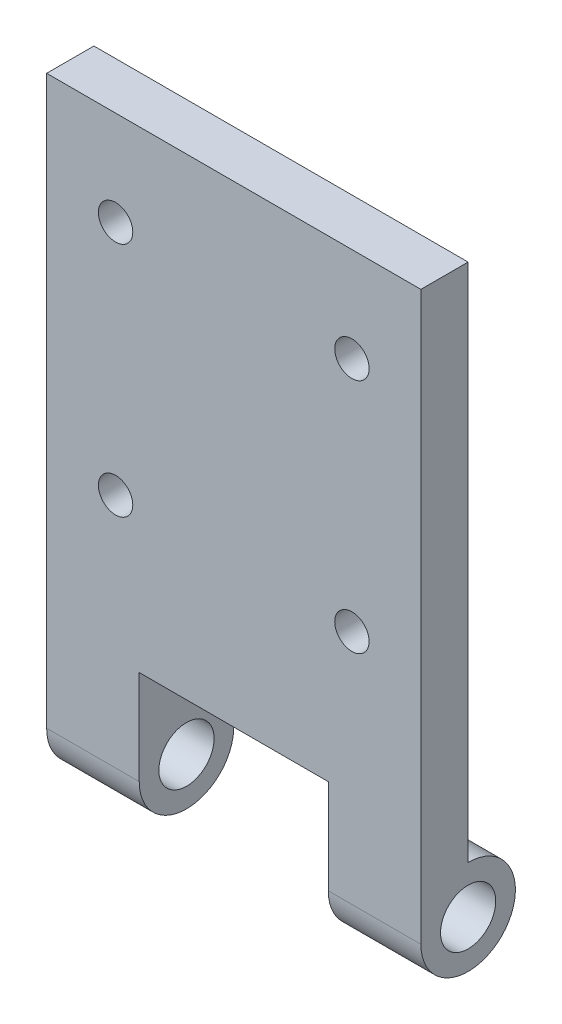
ISO-10303-21;
HEADER;
FILE_DESCRIPTION(('STEP AP214'),'2;1');
FILE_NAME('part.step','',(''),(''),'','','');
FILE_SCHEMA(('AUTOMOTIVE_DESIGN { 1 0 10303 214 1 1 1 1 }'));
ENDSEC;
DATA;
#1=APPLICATION_CONTEXT('core data for automotive mechanical design processes');
#2=APPLICATION_PROTOCOL_DEFINITION('international standard','automotive_design',2000,#1);
#3=PRODUCT_CONTEXT('',#1,'mechanical');
#4=PRODUCT('Part','Part','',(#3));
#5=PRODUCT_RELATED_PRODUCT_CATEGORY('part','',(#4));
#6=PRODUCT_DEFINITION_FORMATION('','',#4);
#7=PRODUCT_DEFINITION_CONTEXT('part definition',#1,'design');
#8=PRODUCT_DEFINITION('design','',#6,#7);
#9=PRODUCT_DEFINITION_SHAPE('','',#8);
#10=(LENGTH_UNIT() NAMED_UNIT(*) SI_UNIT(.MILLI.,.METRE.));
#11=(NAMED_UNIT(*) PLANE_ANGLE_UNIT() SI_UNIT($,.RADIAN.));
#12=(NAMED_UNIT(*) SI_UNIT($,.STERADIAN.) SOLID_ANGLE_UNIT());
#13=UNCERTAINTY_MEASURE_WITH_UNIT(LENGTH_MEASURE(1.E-05),#10,'distance_accuracy_value','');
#14=(GEOMETRIC_REPRESENTATION_CONTEXT(3) GLOBAL_UNCERTAINTY_ASSIGNED_CONTEXT((#13)) GLOBAL_UNIT_ASSIGNED_CONTEXT((#10,
#11,#12)) REPRESENTATION_CONTEXT('',''));
#15=CARTESIAN_POINT('',(0.,0.,0.));
#16=DIRECTION('',(0.,0.,1.));
#17=DIRECTION('',(1.,0.,0.));
#18=AXIS2_PLACEMENT_3D('',#15,#16,#17);
#19=CARTESIAN_POINT('',(-28.2842712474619,0.,0.));
#20=DIRECTION('',(1.,0.,0.));
#21=DIRECTION('',(0.,1.,0.));
#22=AXIS2_PLACEMENT_3D('',#19,#20,#21);
#23=CYLINDRICAL_SURFACE('',#22,10.);
#24=CARTESIAN_POINT('',(19.5881204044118,0.,0.));
#25=DIRECTION('',(-1.,0.,0.));
#26=DIRECTION('',(0.,0.,1.));
#27=AXIS2_PLACEMENT_3D('',#24,#25,#26);
#28=CIRCLE('',#27,10.);
#29=CARTESIAN_POINT('',(19.5881204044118,0.,10.));
#30=VERTEX_POINT('',#29);
#31=CARTESIAN_POINT('',(19.5881204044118,9.99999999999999,0.));
#32=VERTEX_POINT('',#31);
#33=EDGE_CURVE('E129',#30,#32,#28,.F.);
#34=ORIENTED_EDGE('',*,*,#33,.F.);
#35=DIRECTION('',(1.,0.,0.));
#36=VECTOR('',#35,1.);
#37=CARTESIAN_POINT('',(0.,0.,10.));
#38=LINE('',#37,#36);
#39=CARTESIAN_POINT('',(0.,0.,10.));
#40=VERTEX_POINT('',#39);
#41=EDGE_CURVE('E176',#40,#30,#38,.T.);
#42=ORIENTED_EDGE('',*,*,#41,.F.);
#43=CARTESIAN_POINT('',(0.,0.,0.));
#44=DIRECTION('',(1.,0.,0.));
#45=DIRECTION('',(0.,0.,-1.));
#46=AXIS2_PLACEMENT_3D('',#43,#44,#45);
#47=CIRCLE('',#46,10.);
#48=CARTESIAN_POINT('',(0.,9.99999999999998,0.));
#49=VERTEX_POINT('',#48);
#50=EDGE_CURVE('E142',#49,#40,#47,.F.);
#51=ORIENTED_EDGE('',*,*,#50,.F.);
#52=DIRECTION('',(1.,0.,0.));
#53=VECTOR('',#52,1.);
#54=CARTESIAN_POINT('',(-28.2842712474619,9.99999999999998,0.));
#55=LINE('',#54,#53);
#56=EDGE_CURVE('E56',#49,#32,#55,.T.);
#57=ORIENTED_EDGE('',*,*,#56,.T.);
#58=EDGE_LOOP('',(#34,#42,#51,#57));
#59=FACE_BOUND('',#58,.T.);
#60=ADVANCED_FACE('F33',(#59),#23,.T.);
#61=CARTESIAN_POINT('',(0.,0.,0.));
#62=DIRECTION('',(1.,0.,0.));
#63=DIRECTION('',(0.,1.,0.));
#64=AXIS2_PLACEMENT_3D('',#61,#62,#63);
#65=CYLINDRICAL_SURFACE('',#64,5.84494876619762);
#66=CARTESIAN_POINT('',(19.5881204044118,0.,0.));
#67=DIRECTION('',(-1.,0.,0.));
#68=DIRECTION('',(0.,0.,1.));
#69=AXIS2_PLACEMENT_3D('',#66,#67,#68);
#70=CIRCLE('',#69,5.84494876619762);
#71=CARTESIAN_POINT('',(19.5881204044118,5.8449487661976,0.));
#72=VERTEX_POINT('',#71);
#73=EDGE_CURVE('E128',#72,#72,#70,.F.);
#74=CARTESIAN_POINT('',(0.,0.,0.));
#75=DIRECTION('',(1.,0.,0.));
#76=DIRECTION('',(0.,1.,0.));
#77=AXIS2_PLACEMENT_3D('',#74,#75,#76);
#78=CIRCLE('',#77,5.84494876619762);
#79=CARTESIAN_POINT('',(0.,5.8449487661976,0.));
#80=VERTEX_POINT('',#79);
#81=EDGE_CURVE('E134',#80,#80,#78,.T.);
#82=CARTESIAN_POINT('',(19.5881204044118,5.8449487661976,0.));
#83=CARTESIAN_POINT('',(19.3840774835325,5.8449487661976,0.));
#84=CARTESIAN_POINT('',(19.1800345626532,5.8449487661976,0.));
#85=CARTESIAN_POINT('',(18.7719487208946,5.8449487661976,0.));
#86=CARTESIAN_POINT('',(18.5679058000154,5.8449487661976,0.));
#87=CARTESIAN_POINT('',(18.1598199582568,5.8449487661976,0.));
#88=CARTESIAN_POINT('',(17.9557770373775,5.8449487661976,0.));
#89=CARTESIAN_POINT('',(17.5476911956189,5.8449487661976,0.));
#90=CARTESIAN_POINT('',(17.3436482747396,5.8449487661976,0.));
#91=CARTESIAN_POINT('',(16.935562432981,5.8449487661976,0.));
#92=CARTESIAN_POINT('',(16.7315195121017,5.8449487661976,0.));
#93=CARTESIAN_POINT('',(16.3234336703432,5.8449487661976,0.));
#94=CARTESIAN_POINT('',(16.1193907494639,5.8449487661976,0.));
#95=CARTESIAN_POINT('',(15.7113049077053,5.8449487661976,0.));
#96=CARTESIAN_POINT('',(15.507261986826,5.8449487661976,0.));
#97=CARTESIAN_POINT('',(15.0991761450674,5.8449487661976,0.));
#98=CARTESIAN_POINT('',(14.8951332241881,5.8449487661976,0.));
#99=CARTESIAN_POINT('',(14.4870473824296,5.8449487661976,0.));
#100=CARTESIAN_POINT('',(14.2830044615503,5.8449487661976,0.));
#101=CARTESIAN_POINT('',(13.8749186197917,5.8449487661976,0.));
#102=CARTESIAN_POINT('',(13.6708756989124,5.8449487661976,0.));
#103=CARTESIAN_POINT('',(13.2627898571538,5.8449487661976,0.));
#104=CARTESIAN_POINT('',(13.0587469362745,5.8449487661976,0.));
#105=CARTESIAN_POINT('',(12.650661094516,5.8449487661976,0.));
#106=CARTESIAN_POINT('',(12.4466181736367,5.8449487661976,0.));
#107=CARTESIAN_POINT('',(12.0385323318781,5.8449487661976,0.));
#108=CARTESIAN_POINT('',(11.8344894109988,5.8449487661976,0.));
#109=CARTESIAN_POINT('',(11.4264035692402,5.8449487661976,0.));
#110=CARTESIAN_POINT('',(11.2223606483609,5.8449487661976,0.));
#111=CARTESIAN_POINT('',(10.8142748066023,5.8449487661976,0.));
#112=CARTESIAN_POINT('',(10.6102318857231,5.8449487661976,0.));
#113=CARTESIAN_POINT('',(10.2021460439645,5.8449487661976,0.));
#114=CARTESIAN_POINT('',(9.99810312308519,5.8449487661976,0.));
#115=CARTESIAN_POINT('',(9.59001728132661,5.8449487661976,0.));
#116=CARTESIAN_POINT('',(9.38597436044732,5.8449487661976,0.));
#117=CARTESIAN_POINT('',(8.97788851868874,5.8449487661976,0.));
#118=CARTESIAN_POINT('',(8.77384559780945,5.8449487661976,0.));
#119=CARTESIAN_POINT('',(8.36575975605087,5.8449487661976,0.));
#120=CARTESIAN_POINT('',(8.16171683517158,5.8449487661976,0.));
#121=CARTESIAN_POINT('',(7.753630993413,5.8449487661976,0.));
#122=CARTESIAN_POINT('',(7.54958807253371,5.8449487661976,0.));
#123=CARTESIAN_POINT('',(7.14150223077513,5.8449487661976,0.));
#124=CARTESIAN_POINT('',(6.93745930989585,5.8449487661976,0.));
#125=CARTESIAN_POINT('',(6.52937346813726,5.8449487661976,0.));
#126=CARTESIAN_POINT('',(6.32533054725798,5.8449487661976,0.));
#127=CARTESIAN_POINT('',(5.9172447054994,5.8449487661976,0.));
#128=CARTESIAN_POINT('',(5.71320178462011,5.8449487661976,0.));
#129=CARTESIAN_POINT('',(5.30511594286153,5.8449487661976,0.));
#130=CARTESIAN_POINT('',(5.10107302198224,5.8449487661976,0.));
#131=CARTESIAN_POINT('',(4.69298718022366,5.8449487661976,0.));
#132=CARTESIAN_POINT('',(4.48894425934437,5.8449487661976,0.));
#133=CARTESIAN_POINT('',(4.08085841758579,5.8449487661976,0.));
#134=CARTESIAN_POINT('',(3.8768154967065,5.8449487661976,0.));
#135=CARTESIAN_POINT('',(3.46872965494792,5.8449487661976,0.));
#136=CARTESIAN_POINT('',(3.26468673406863,5.8449487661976,0.));
#137=CARTESIAN_POINT('',(2.85660089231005,5.8449487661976,0.));
#138=CARTESIAN_POINT('',(2.65255797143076,5.8449487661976,0.));
#139=CARTESIAN_POINT('',(2.24447212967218,5.8449487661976,0.));
#140=CARTESIAN_POINT('',(2.04042920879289,5.8449487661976,0.));
#141=CARTESIAN_POINT('',(1.63234336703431,5.8449487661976,0.));
#142=CARTESIAN_POINT('',(1.42830044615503,5.8449487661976,0.));
#143=CARTESIAN_POINT('',(1.02021460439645,5.8449487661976,0.));
#144=CARTESIAN_POINT('',(0.816171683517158,5.8449487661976,0.));
#145=CARTESIAN_POINT('',(0.408085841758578,5.8449487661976,0.));
#146=CARTESIAN_POINT('',(0.204042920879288,5.8449487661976,0.));
#147=CARTESIAN_POINT('',(0.,5.8449487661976,0.));
#148=B_SPLINE_CURVE_WITH_KNOTS('',3,(#82,#83,#84,#85,#86,#87,#88,#89,#90,#91,#92,#93,#94,#95,
#96,#97,#98,#99,#100,#101,#102,#103,#104,#105,#106,#107,#108,#109,#110,#111,#112,#113,#114,#115,
#116,#117,#118,#119,#120,#121,#122,#123,#124,#125,#126,#127,#128,#129,#130,#131,#132,#133,#134,
#135,#136,#137,#138,#139,#140,#141,#142,#143,#144,#145,#146,#147),.UNSPECIFIED.,.F.,.F.,(4,2,2,
2,2,2,2,2,2,2,2,2,2,2,2,2,2,2,2,2,2,2,2,2,2,2,2,2,2,2,2,2,4),(0.,0.61212876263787,
1.22425752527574,1.83638628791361,2.44851505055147,3.06064381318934,3.67277257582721,
4.28490133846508,4.89703010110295,5.50915886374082,6.12128762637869,6.73341638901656,
7.34554515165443,7.95767391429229,8.56980267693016,9.18193143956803,9.7940602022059,
10.4061889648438,11.0183177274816,11.6304464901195,12.2425752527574,12.8547040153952,
13.4668327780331,14.078961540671,14.6910903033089,15.3032190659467,15.9153478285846,
16.5274765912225,17.1396053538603,17.7517341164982,18.3638628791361,18.9759916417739,
19.5881204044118),.UNSPECIFIED.);
#149=EDGE_CURVE('BSEAM195',#72,#80,#148,.T.);
#150=ORIENTED_EDGE('',*,*,#73,.T.);
#151=ORIENTED_EDGE('',*,*,#81,.F.);
#152=ORIENTED_EDGE('',*,*,#149,.T.);
#153=ORIENTED_EDGE('',*,*,#149,.F.);
#154=EDGE_LOOP('',(#150,#152,#151,#153));
#155=FACE_BOUND('',#154,.T.);
#156=ADVANCED_FACE('F195',(#155),#65,.F.);
#157=CARTESIAN_POINT('',(0.,0.,10.));
#158=DIRECTION('',(0.,0.,-1.));
#159=DIRECTION('',(-1.,0.,0.));
#160=AXIS2_PLACEMENT_3D('',#157,#158,#159);
#161=PLANE('',#160);
#162=ORIENTED_EDGE('',*,*,#41,.T.);
#163=DIRECTION('',(0.,-1.,0.));
#164=VECTOR('',#163,1.);
#165=CARTESIAN_POINT('',(19.5881204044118,-13.8180608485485,10.));
#166=LINE('',#165,#164);
#167=CARTESIAN_POINT('',(19.5881204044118,20.,10.));
#168=VERTEX_POINT('',#167);
#169=EDGE_CURVE('E108',#168,#30,#166,.T.);
#170=ORIENTED_EDGE('',*,*,#169,.F.);
#171=DIRECTION('',(-1.,0.,0.));
#172=VECTOR('',#171,1.);
#173=CARTESIAN_POINT('',(19.5881204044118,20.,10.));
#174=LINE('',#173,#172);
#175=CARTESIAN_POINT('',(59.5881204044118,20.,10.));
#176=VERTEX_POINT('',#175);
#177=EDGE_CURVE('E104',#176,#168,#174,.T.);
#178=ORIENTED_EDGE('',*,*,#177,.F.);
#179=DIRECTION('',(0.,1.,0.));
#180=VECTOR('',#179,1.);
#181=CARTESIAN_POINT('',(59.5881204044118,-13.8180608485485,10.));
#182=LINE('',#181,#180);
#183=CARTESIAN_POINT('',(59.5881204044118,0.,10.));
#184=VERTEX_POINT('',#183);
#185=EDGE_CURVE('E111',#184,#176,#182,.T.);
#186=ORIENTED_EDGE('',*,*,#185,.F.);
#187=CARTESIAN_POINT('',(79.1762408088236,0.,10.));
#188=VERTEX_POINT('',#187);
#189=EDGE_CURVE('E174',#184,#188,#38,.T.);
#190=ORIENTED_EDGE('',*,*,#189,.T.);
#191=DIRECTION('',(0.,1.,0.));
#192=VECTOR('',#191,1.);
#193=CARTESIAN_POINT('',(79.1762408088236,0.,10.));
#194=LINE('',#193,#192);
#195=CARTESIAN_POINT('',(79.1762408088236,120.,10.));
#196=VERTEX_POINT('',#195);
#197=EDGE_CURVE('E178',#188,#196,#194,.T.);
#198=ORIENTED_EDGE('',*,*,#197,.T.);
#199=DIRECTION('',(-1.,0.,0.));
#200=VECTOR('',#199,1.);
#201=CARTESIAN_POINT('',(0.,120.,10.));
#202=LINE('',#201,#200);
#203=CARTESIAN_POINT('',(0.,120.,10.));
#204=VERTEX_POINT('',#203);
#205=EDGE_CURVE('E180',#196,#204,#202,.T.);
#206=ORIENTED_EDGE('',*,*,#205,.T.);
#207=DIRECTION('',(0.,-1.,0.));
#208=VECTOR('',#207,1.);
#209=CARTESIAN_POINT('',(0.,0.,10.));
#210=LINE('',#209,#208);
#211=EDGE_CURVE('E172',#204,#40,#210,.T.);
#212=ORIENTED_EDGE('',*,*,#211,.T.);
#213=EDGE_LOOP('',(#162,#170,#178,#186,#190,#198,#206,#212));
#214=FACE_BOUND('',#213,.T.);
#215=CARTESIAN_POINT('',(14.5881204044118,50.,10.));
#216=DIRECTION('',(0.,0.,1.));
#217=DIRECTION('',(1.,0.,0.));
#218=AXIS2_PLACEMENT_3D('',#215,#216,#217);
#219=CIRCLE('',#218,3.63560199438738);
#220=CARTESIAN_POINT('',(18.2237223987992,50.,10.));
#221=VERTEX_POINT('',#220);
#222=EDGE_CURVE('E166',#221,#221,#219,.T.);
#223=ORIENTED_EDGE('',*,*,#222,.F.);
#224=EDGE_LOOP('',(#223));
#225=FACE_BOUND('',#224,.T.);
#226=CARTESIAN_POINT('',(14.5881204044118,100.,10.));
#227=DIRECTION('',(0.,0.,1.));
#228=DIRECTION('',(1.,0.,0.));
#229=AXIS2_PLACEMENT_3D('',#226,#227,#228);
#230=CIRCLE('',#229,3.63560199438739);
#231=CARTESIAN_POINT('',(18.2237223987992,100.,10.));
#232=VERTEX_POINT('',#231);
#233=EDGE_CURVE('E160',#232,#232,#230,.T.);
#234=ORIENTED_EDGE('',*,*,#233,.F.);
#235=EDGE_LOOP('',(#234));
#236=FACE_BOUND('',#235,.T.);
#237=CARTESIAN_POINT('',(64.5881204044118,100.,10.));
#238=DIRECTION('',(0.,0.,1.));
#239=DIRECTION('',(-1.,0.,0.));
#240=AXIS2_PLACEMENT_3D('',#237,#238,#239);
#241=CIRCLE('',#240,3.63560199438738);
#242=CARTESIAN_POINT('',(60.9525184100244,100.,10.));
#243=VERTEX_POINT('',#242);
#244=EDGE_CURVE('E154',#243,#243,#241,.T.);
#245=ORIENTED_EDGE('',*,*,#244,.F.);
#246=EDGE_LOOP('',(#245));
#247=FACE_BOUND('',#246,.T.);
#248=CARTESIAN_POINT('',(64.5881204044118,50.,10.));
#249=DIRECTION('',(0.,0.,1.));
#250=DIRECTION('',(-1.,0.,0.));
#251=AXIS2_PLACEMENT_3D('',#248,#249,#250);
#252=CIRCLE('',#251,3.63560199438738);
#253=CARTESIAN_POINT('',(60.9525184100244,50.,10.));
#254=VERTEX_POINT('',#253);
#255=EDGE_CURVE('E148',#254,#254,#252,.T.);
#256=ORIENTED_EDGE('',*,*,#255,.F.);
#257=EDGE_LOOP('',(#256));
#258=FACE_BOUND('',#257,.T.);
#259=ADVANCED_FACE('F119',(#214,#225,#236,#247,#258),#161,.F.);
#260=CARTESIAN_POINT('',(0.,0.,0.));
#261=DIRECTION('',(0.,0.,-1.));
#262=DIRECTION('',(-1.,0.,0.));
#263=AXIS2_PLACEMENT_3D('',#260,#261,#262);
#264=PLANE('',#263);
#265=DIRECTION('',(0.,1.,0.));
#266=VECTOR('',#265,1.);
#267=CARTESIAN_POINT('',(19.5881204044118,0.,0.));
#268=LINE('',#267,#266);
#269=CARTESIAN_POINT('',(19.5881204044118,20.,0.));
#270=VERTEX_POINT('',#269);
#271=EDGE_CURVE('E131',#32,#270,#268,.T.);
#272=ORIENTED_EDGE('',*,*,#271,.F.);
#273=ORIENTED_EDGE('',*,*,#56,.F.);
#274=DIRECTION('',(0.,-1.,0.));
#275=VECTOR('',#274,1.);
#276=CARTESIAN_POINT('',(0.,0.,0.));
#277=LINE('',#276,#275);
#278=CARTESIAN_POINT('',(0.,120.,0.));
#279=VERTEX_POINT('',#278);
#280=EDGE_CURVE('E169',#279,#49,#277,.T.);
#281=ORIENTED_EDGE('',*,*,#280,.F.);
#282=DIRECTION('',(-1.,0.,0.));
#283=VECTOR('',#282,1.);
#284=CARTESIAN_POINT('',(0.,120.,0.));
#285=LINE('',#284,#283);
#286=CARTESIAN_POINT('',(79.1762408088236,120.,0.));
#287=VERTEX_POINT('',#286);
#288=EDGE_CURVE('E175',#287,#279,#285,.T.);
#289=ORIENTED_EDGE('',*,*,#288,.F.);
#290=DIRECTION('',(0.,1.,0.));
#291=VECTOR('',#290,1.);
#292=CARTESIAN_POINT('',(79.1762408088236,0.,0.));
#293=LINE('',#292,#291);
#294=CARTESIAN_POINT('',(79.1762408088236,10.,0.));
#295=VERTEX_POINT('',#294);
#296=EDGE_CURVE('E184',#295,#287,#293,.T.);
#297=ORIENTED_EDGE('',*,*,#296,.F.);
#298=CARTESIAN_POINT('',(59.5881204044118,10.,0.));
#299=VERTEX_POINT('',#298);
#300=EDGE_CURVE('E145',#299,#295,#55,.T.);
#301=ORIENTED_EDGE('',*,*,#300,.F.);
#302=DIRECTION('',(0.,-1.,0.));
#303=VECTOR('',#302,1.);
#304=CARTESIAN_POINT('',(59.5881204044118,0.,0.));
#305=LINE('',#304,#303);
#306=CARTESIAN_POINT('',(59.5881204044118,20.,0.));
#307=VERTEX_POINT('',#306);
#308=EDGE_CURVE('E48',#307,#299,#305,.T.);
#309=ORIENTED_EDGE('',*,*,#308,.F.);
#310=DIRECTION('',(1.,0.,0.));
#311=VECTOR('',#310,1.);
#312=CARTESIAN_POINT('',(0.,20.,0.));
#313=LINE('',#312,#311);
#314=EDGE_CURVE('E11',#270,#307,#313,.T.);
#315=ORIENTED_EDGE('',*,*,#314,.F.);
#316=EDGE_LOOP('',(#272,#273,#281,#289,#297,#301,#309,#315));
#317=FACE_BOUND('',#316,.T.);
#318=CARTESIAN_POINT('',(64.5881204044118,100.,0.));
#319=DIRECTION('',(0.,0.,1.));
#320=DIRECTION('',(-1.,0.,0.));
#321=AXIS2_PLACEMENT_3D('',#318,#319,#320);
#322=CIRCLE('',#321,3.63560199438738);
#323=CARTESIAN_POINT('',(60.9525184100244,100.,0.));
#324=VERTEX_POINT('',#323);
#325=EDGE_CURVE('E151',#324,#324,#322,.T.);
#326=ORIENTED_EDGE('',*,*,#325,.T.);
#327=EDGE_LOOP('',(#326));
#328=FACE_BOUND('',#327,.T.);
#329=CARTESIAN_POINT('',(14.5881204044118,50.,0.));
#330=DIRECTION('',(0.,0.,1.));
#331=DIRECTION('',(1.,0.,0.));
#332=AXIS2_PLACEMENT_3D('',#329,#330,#331);
#333=CIRCLE('',#332,3.63560199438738);
#334=CARTESIAN_POINT('',(18.2237223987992,50.,0.));
#335=VERTEX_POINT('',#334);
#336=EDGE_CURVE('E163',#335,#335,#333,.T.);
#337=ORIENTED_EDGE('',*,*,#336,.T.);
#338=EDGE_LOOP('',(#337));
#339=FACE_BOUND('',#338,.T.);
#340=CARTESIAN_POINT('',(14.5881204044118,100.,0.));
#341=DIRECTION('',(0.,0.,1.));
#342=DIRECTION('',(1.,0.,0.));
#343=AXIS2_PLACEMENT_3D('',#340,#341,#342);
#344=CIRCLE('',#343,3.63560199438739);
#345=CARTESIAN_POINT('',(18.2237223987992,100.,0.));
#346=VERTEX_POINT('',#345);
#347=EDGE_CURVE('E157',#346,#346,#344,.T.);
#348=ORIENTED_EDGE('',*,*,#347,.T.);
#349=EDGE_LOOP('',(#348));
#350=FACE_BOUND('',#349,.T.);
#351=CARTESIAN_POINT('',(64.5881204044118,50.,0.));
#352=DIRECTION('',(0.,0.,1.));
#353=DIRECTION('',(-1.,0.,0.));
#354=AXIS2_PLACEMENT_3D('',#351,#352,#353);
#355=CIRCLE('',#354,3.63560199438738);
#356=CARTESIAN_POINT('',(60.9525184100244,50.,0.));
#357=VERTEX_POINT('',#356);
#358=EDGE_CURVE('E147',#357,#357,#355,.T.);
#359=ORIENTED_EDGE('',*,*,#358,.T.);
#360=EDGE_LOOP('',(#359));
#361=FACE_BOUND('',#360,.T.);
#362=ADVANCED_FACE('F234',(#317,#328,#339,#350,#361),#264,.T.);
#363=CARTESIAN_POINT('',(0.,0.,10.));
#364=DIRECTION('',(1.,0.,0.));
#365=DIRECTION('',(0.,0.,-1.));
#366=AXIS2_PLACEMENT_3D('',#363,#364,#365);
#367=PLANE('',#366);
#368=ORIENTED_EDGE('',*,*,#81,.T.);
#369=EDGE_LOOP('',(#368));
#370=FACE_BOUND('',#369,.T.);
#371=ORIENTED_EDGE('',*,*,#280,.T.);
#372=ORIENTED_EDGE('',*,*,#50,.T.);
#373=ORIENTED_EDGE('',*,*,#211,.F.);
#374=DIRECTION('',(0.,0.,-1.));
#375=VECTOR('',#374,1.);
#376=CARTESIAN_POINT('',(0.,120.,10.));
#377=LINE('',#376,#375);
#378=EDGE_CURVE('E182',#204,#279,#377,.T.);
#379=ORIENTED_EDGE('',*,*,#378,.T.);
#380=EDGE_LOOP('',(#371,#372,#373,#379));
#381=FACE_BOUND('',#380,.T.);
#382=ADVANCED_FACE('F35',(#370,#381),#367,.F.);
#383=CARTESIAN_POINT('',(79.1762408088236,0.,10.));
#384=DIRECTION('',(-1.,0.,0.));
#385=DIRECTION('',(0.,-1.,0.));
#386=AXIS2_PLACEMENT_3D('',#383,#384,#385);
#387=PLANE('',#386);
#388=CARTESIAN_POINT('',(79.1762408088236,0.,0.));
#389=DIRECTION('',(1.,0.,0.));
#390=DIRECTION('',(0.,1.,0.));
#391=AXIS2_PLACEMENT_3D('',#388,#389,#390);
#392=CIRCLE('',#391,5.84494876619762);
#393=CARTESIAN_POINT('',(79.1762408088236,5.84494876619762,0.));
#394=VERTEX_POINT('',#393);
#395=EDGE_CURVE('E133',#394,#394,#392,.T.);
#396=ORIENTED_EDGE('',*,*,#395,.F.);
#397=EDGE_LOOP('',(#396));
#398=FACE_BOUND('',#397,.T.);
#399=CARTESIAN_POINT('',(79.1762408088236,0.,0.));
#400=DIRECTION('',(1.,0.,0.));
#401=DIRECTION('',(0.,1.,0.));
#402=AXIS2_PLACEMENT_3D('',#399,#400,#401);
#403=CIRCLE('',#402,10.);
#404=EDGE_CURVE('E137',#188,#295,#403,.T.);
#405=ORIENTED_EDGE('',*,*,#404,.T.);
#406=ORIENTED_EDGE('',*,*,#296,.T.);
#407=DIRECTION('',(0.,0.,-1.));
#408=VECTOR('',#407,1.);
#409=CARTESIAN_POINT('',(79.1762408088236,120.,10.));
#410=LINE('',#409,#408);
#411=EDGE_CURVE('E41',#196,#287,#410,.T.);
#412=ORIENTED_EDGE('',*,*,#411,.F.);
#413=ORIENTED_EDGE('',*,*,#197,.F.);
#414=EDGE_LOOP('',(#405,#406,#412,#413));
#415=FACE_BOUND('',#414,.T.);
#416=ADVANCED_FACE('F240',(#398,#415),#387,.F.);
#417=CARTESIAN_POINT('',(0.,120.,10.));
#418=DIRECTION('',(0.,-1.,0.));
#419=DIRECTION('',(1.,0.,0.));
#420=AXIS2_PLACEMENT_3D('',#417,#418,#419);
#421=PLANE('',#420);
#422=ORIENTED_EDGE('',*,*,#288,.T.);
#423=ORIENTED_EDGE('',*,*,#378,.F.);
#424=ORIENTED_EDGE('',*,*,#205,.F.);
#425=ORIENTED_EDGE('',*,*,#411,.T.);
#426=EDGE_LOOP('',(#422,#423,#424,#425));
#427=FACE_BOUND('',#426,.T.);
#428=ADVANCED_FACE('F246',(#427),#421,.F.);
#429=CARTESIAN_POINT('',(14.5881204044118,50.,10.));
#430=DIRECTION('',(0.,0.,-1.));
#431=DIRECTION('',(-1.,0.,0.));
#432=AXIS2_PLACEMENT_3D('',#429,#430,#431);
#433=CYLINDRICAL_SURFACE('',#432,3.63560199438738);
#434=ORIENTED_EDGE('',*,*,#222,.T.);
#435=EDGE_LOOP('',(#434));
#436=FACE_BOUND('',#435,.T.);
#437=ORIENTED_EDGE('',*,*,#336,.F.);
#438=EDGE_LOOP('',(#437));
#439=FACE_BOUND('',#438,.T.);
#440=ADVANCED_FACE('F264',(#436,#439),#433,.F.);
#441=CARTESIAN_POINT('',(14.5881204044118,100.,10.));
#442=DIRECTION('',(0.,0.,-1.));
#443=DIRECTION('',(-1.,0.,0.));
#444=AXIS2_PLACEMENT_3D('',#441,#442,#443);
#445=CYLINDRICAL_SURFACE('',#444,3.63560199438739);
#446=ORIENTED_EDGE('',*,*,#233,.T.);
#447=EDGE_LOOP('',(#446));
#448=FACE_BOUND('',#447,.T.);
#449=ORIENTED_EDGE('',*,*,#347,.F.);
#450=EDGE_LOOP('',(#449));
#451=FACE_BOUND('',#450,.T.);
#452=ADVANCED_FACE('F268',(#448,#451),#445,.F.);
#453=CARTESIAN_POINT('',(64.5881204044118,100.,10.));
#454=DIRECTION('',(0.,0.,-1.));
#455=DIRECTION('',(-1.,0.,0.));
#456=AXIS2_PLACEMENT_3D('',#453,#454,#455);
#457=CYLINDRICAL_SURFACE('',#456,3.63560199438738);
#458=ORIENTED_EDGE('',*,*,#244,.T.);
#459=EDGE_LOOP('',(#458));
#460=FACE_BOUND('',#459,.T.);
#461=ORIENTED_EDGE('',*,*,#325,.F.);
#462=EDGE_LOOP('',(#461));
#463=FACE_BOUND('',#462,.T.);
#464=ADVANCED_FACE('F229',(#460,#463),#457,.F.);
#465=CARTESIAN_POINT('',(64.5881204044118,50.,10.));
#466=DIRECTION('',(0.,0.,-1.));
#467=DIRECTION('',(-1.,0.,0.));
#468=AXIS2_PLACEMENT_3D('',#465,#466,#467);
#469=CYLINDRICAL_SURFACE('',#468,3.63560199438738);
#470=ORIENTED_EDGE('',*,*,#255,.T.);
#471=EDGE_LOOP('',(#470));
#472=FACE_BOUND('',#471,.T.);
#473=ORIENTED_EDGE('',*,*,#358,.F.);
#474=EDGE_LOOP('',(#473));
#475=FACE_BOUND('',#474,.T.);
#476=ADVANCED_FACE('F223',(#472,#475),#469,.F.);
#477=CARTESIAN_POINT('',(59.5881204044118,0.,0.));
#478=DIRECTION('',(1.,0.,0.));
#479=DIRECTION('',(0.,0.,-1.));
#480=AXIS2_PLACEMENT_3D('',#477,#478,#479);
#481=CIRCLE('',#480,10.);
#482=EDGE_CURVE('E114',#299,#184,#481,.F.);
#483=ORIENTED_EDGE('',*,*,#482,.F.);
#484=ORIENTED_EDGE('',*,*,#300,.T.);
#485=ORIENTED_EDGE('',*,*,#404,.F.);
#486=ORIENTED_EDGE('',*,*,#189,.F.);
#487=EDGE_LOOP('',(#483,#484,#485,#486));
#488=FACE_BOUND('',#487,.T.);
#489=ADVANCED_FACE('F209',(#488),#23,.T.);
#490=CARTESIAN_POINT('',(59.5881204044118,0.,0.));
#491=DIRECTION('',(1.,0.,0.));
#492=DIRECTION('',(0.,0.,-1.));
#493=AXIS2_PLACEMENT_3D('',#490,#491,#492);
#494=CIRCLE('',#493,5.84494876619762);
#495=CARTESIAN_POINT('',(59.5881204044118,5.84494876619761,0.));
#496=VERTEX_POINT('',#495);
#497=EDGE_CURVE('E124',#496,#496,#494,.F.);
#498=CARTESIAN_POINT('',(59.5881204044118,5.84494876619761,0.));
#499=CARTESIAN_POINT('',(59.7921633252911,5.84494876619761,0.));
#500=CARTESIAN_POINT('',(59.9962062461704,5.84494876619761,0.));
#501=CARTESIAN_POINT('',(60.404292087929,5.84494876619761,0.));
#502=CARTESIAN_POINT('',(60.6083350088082,5.84494876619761,0.));
#503=CARTESIAN_POINT('',(61.0164208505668,5.84494876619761,0.));
#504=CARTESIAN_POINT('',(61.2204637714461,5.84494876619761,0.));
#505=CARTESIAN_POINT('',(61.6285496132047,5.84494876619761,0.));
#506=CARTESIAN_POINT('',(61.832592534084,5.84494876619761,0.));
#507=CARTESIAN_POINT('',(62.2406783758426,5.84494876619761,0.));
#508=CARTESIAN_POINT('',(62.4447212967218,5.84494876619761,0.));
#509=CARTESIAN_POINT('',(62.8528071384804,5.84494876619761,0.));
#510=CARTESIAN_POINT('',(63.0568500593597,5.84494876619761,0.));
#511=CARTESIAN_POINT('',(63.4649359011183,5.84494876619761,0.));
#512=CARTESIAN_POINT('',(63.6689788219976,5.84494876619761,0.));
#513=CARTESIAN_POINT('',(64.0770646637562,5.84494876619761,0.));
#514=CARTESIAN_POINT('',(64.2811075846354,5.84494876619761,0.));
#515=CARTESIAN_POINT('',(64.689193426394,5.84494876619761,0.));
#516=CARTESIAN_POINT('',(64.8932363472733,5.84494876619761,0.));
#517=CARTESIAN_POINT('',(65.3013221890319,5.84494876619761,0.));
#518=CARTESIAN_POINT('',(65.5053651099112,5.84494876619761,0.));
#519=CARTESIAN_POINT('',(65.9134509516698,5.84494876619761,0.));
#520=CARTESIAN_POINT('',(66.1174938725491,5.84494876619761,0.));
#521=CARTESIAN_POINT('',(66.5255797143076,5.84494876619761,0.));
#522=CARTESIAN_POINT('',(66.7296226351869,5.84494876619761,0.));
#523=CARTESIAN_POINT('',(67.1377084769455,5.84494876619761,0.));
#524=CARTESIAN_POINT('',(67.3417513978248,5.84494876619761,0.));
#525=CARTESIAN_POINT('',(67.7498372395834,5.84494876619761,0.));
#526=CARTESIAN_POINT('',(67.9538801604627,5.84494876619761,0.));
#527=CARTESIAN_POINT('',(68.3619660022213,5.84494876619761,0.));
#528=CARTESIAN_POINT('',(68.5660089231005,5.84494876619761,0.));
#529=CARTESIAN_POINT('',(68.9740947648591,5.84494876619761,0.));
#530=CARTESIAN_POINT('',(69.1781376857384,5.84494876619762,0.));
#531=CARTESIAN_POINT('',(69.586223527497,5.84494876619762,0.));
#532=CARTESIAN_POINT('',(69.7902664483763,5.84494876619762,0.));
#533=CARTESIAN_POINT('',(70.1983522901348,5.84494876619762,0.));
#534=CARTESIAN_POINT('',(70.4023952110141,5.84494876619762,0.));
#535=CARTESIAN_POINT('',(70.8104810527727,5.84494876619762,0.));
#536=CARTESIAN_POINT('',(71.014523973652,5.84494876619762,0.));
#537=CARTESIAN_POINT('',(71.4226098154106,5.84494876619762,0.));
#538=CARTESIAN_POINT('',(71.6266527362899,5.84494876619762,0.));
#539=CARTESIAN_POINT('',(72.0347385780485,5.84494876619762,0.));
#540=CARTESIAN_POINT('',(72.2387814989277,5.84494876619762,0.));
#541=CARTESIAN_POINT('',(72.6468673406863,5.84494876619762,0.));
#542=CARTESIAN_POINT('',(72.8509102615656,5.84494876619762,0.));
#543=CARTESIAN_POINT('',(73.2589961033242,5.84494876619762,0.));
#544=CARTESIAN_POINT('',(73.4630390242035,5.84494876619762,0.));
#545=CARTESIAN_POINT('',(73.8711248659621,5.84494876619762,0.));
#546=CARTESIAN_POINT('',(74.0751677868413,5.84494876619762,0.));
#547=CARTESIAN_POINT('',(74.4832536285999,5.84494876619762,0.));
#548=CARTESIAN_POINT('',(74.6872965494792,5.84494876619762,0.));
#549=CARTESIAN_POINT('',(75.0953823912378,5.84494876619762,0.));
#550=CARTESIAN_POINT('',(75.2994253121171,5.84494876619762,0.));
#551=CARTESIAN_POINT('',(75.7075111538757,5.84494876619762,0.));
#552=CARTESIAN_POINT('',(75.9115540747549,5.84494876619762,0.));
#553=CARTESIAN_POINT('',(76.3196399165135,5.84494876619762,0.));
#554=CARTESIAN_POINT('',(76.5236828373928,5.84494876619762,0.));
#555=CARTESIAN_POINT('',(76.9317686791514,5.84494876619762,0.));
#556=CARTESIAN_POINT('',(77.1358116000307,5.84494876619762,0.));
#557=CARTESIAN_POINT('',(77.5438974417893,5.84494876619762,0.));
#558=CARTESIAN_POINT('',(77.7479403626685,5.84494876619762,0.));
#559=CARTESIAN_POINT('',(78.1560262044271,5.84494876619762,0.));
#560=CARTESIAN_POINT('',(78.3600691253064,5.84494876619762,0.));
#561=CARTESIAN_POINT('',(78.768154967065,5.84494876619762,0.));
#562=CARTESIAN_POINT('',(78.9721978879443,5.84494876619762,0.));
#563=CARTESIAN_POINT('',(79.1762408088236,5.84494876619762,0.));
#564=B_SPLINE_CURVE_WITH_KNOTS('',3,(#498,#499,#500,#501,#502,#503,#504,#505,#506,#507,#508,
#509,#510,#511,#512,#513,#514,#515,#516,#517,#518,#519,#520,#521,#522,#523,#524,#525,#526,#527,
#528,#529,#530,#531,#532,#533,#534,#535,#536,#537,#538,#539,#540,#541,#542,#543,#544,#545,#546,
#547,#548,#549,#550,#551,#552,#553,#554,#555,#556,#557,#558,#559,#560,#561,#562,#563),
.UNSPECIFIED.,.F.,.F.,(4,2,2,2,2,2,2,2,2,2,2,2,2,2,2,2,2,2,2,2,2,2,2,2,2,2,2,2,2,2,2,2,4),(0.,
0.612128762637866,1.22425752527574,1.83638628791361,2.44851505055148,3.06064381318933,
3.6727725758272,4.28490133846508,4.89703010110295,5.50915886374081,6.12128762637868,
6.73341638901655,7.34554515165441,7.95767391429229,8.56980267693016,9.18193143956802,
9.79406020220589,10.4061889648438,11.0183177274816,11.6304464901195,12.2425752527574,
12.8547040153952,13.4668327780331,14.078961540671,14.6910903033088,15.3032190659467,
15.9153478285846,16.5274765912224,17.1396053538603,17.7517341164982,18.363862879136,
18.9759916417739,19.5881204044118),.UNSPECIFIED.);
#565=EDGE_CURVE('BSEAM200',#496,#394,#564,.T.);
#566=ORIENTED_EDGE('',*,*,#497,.T.);
#567=ORIENTED_EDGE('',*,*,#395,.T.);
#568=ORIENTED_EDGE('',*,*,#565,.T.);
#569=ORIENTED_EDGE('',*,*,#565,.F.);
#570=EDGE_LOOP('',(#566,#568,#567,#569));
#571=FACE_BOUND('',#570,.T.);
#572=ADVANCED_FACE('F200',(#571),#65,.F.);
#573=CARTESIAN_POINT('',(19.5881204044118,-13.8180608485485,-20.));
#574=DIRECTION('',(-1.,0.,0.));
#575=DIRECTION('',(0.,0.,1.));
#576=AXIS2_PLACEMENT_3D('',#573,#574,#575);
#577=PLANE('',#576);
#578=ORIENTED_EDGE('',*,*,#271,.T.);
#579=DIRECTION('',(0.,0.,1.));
#580=VECTOR('',#579,1.);
#581=CARTESIAN_POINT('',(19.5881204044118,20.,-20.));
#582=LINE('',#581,#580);
#583=EDGE_CURVE('E107',#270,#168,#582,.T.);
#584=ORIENTED_EDGE('',*,*,#583,.T.);
#585=ORIENTED_EDGE('',*,*,#169,.T.);
#586=ORIENTED_EDGE('',*,*,#33,.T.);
#587=EDGE_LOOP('',(#578,#584,#585,#586));
#588=FACE_BOUND('',#587,.T.);
#589=ORIENTED_EDGE('',*,*,#73,.F.);
#590=EDGE_LOOP('',(#589));
#591=FACE_BOUND('',#590,.T.);
#592=ADVANCED_FACE('F198',(#588,#591),#577,.F.);
#593=CARTESIAN_POINT('',(59.5881204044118,-13.8180608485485,-20.));
#594=DIRECTION('',(1.,0.,0.));
#595=DIRECTION('',(0.,0.,-1.));
#596=AXIS2_PLACEMENT_3D('',#593,#594,#595);
#597=PLANE('',#596);
#598=ORIENTED_EDGE('',*,*,#308,.T.);
#599=ORIENTED_EDGE('',*,*,#482,.T.);
#600=ORIENTED_EDGE('',*,*,#185,.T.);
#601=DIRECTION('',(0.,0.,1.));
#602=VECTOR('',#601,1.);
#603=CARTESIAN_POINT('',(59.5881204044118,20.,-20.));
#604=LINE('',#603,#602);
#605=EDGE_CURVE('E99',#307,#176,#604,.T.);
#606=ORIENTED_EDGE('',*,*,#605,.F.);
#607=EDGE_LOOP('',(#598,#599,#600,#606));
#608=FACE_BOUND('',#607,.T.);
#609=ORIENTED_EDGE('',*,*,#497,.F.);
#610=EDGE_LOOP('',(#609));
#611=FACE_BOUND('',#610,.T.);
#612=ADVANCED_FACE('F112',(#608,#611),#597,.F.);
#613=CARTESIAN_POINT('',(19.5881204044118,20.,-20.));
#614=DIRECTION('',(0.,1.,0.));
#615=DIRECTION('',(0.,0.,1.));
#616=AXIS2_PLACEMENT_3D('',#613,#614,#615);
#617=PLANE('',#616);
#618=ORIENTED_EDGE('',*,*,#314,.T.);
#619=ORIENTED_EDGE('',*,*,#605,.T.);
#620=ORIENTED_EDGE('',*,*,#177,.T.);
#621=ORIENTED_EDGE('',*,*,#583,.F.);
#622=EDGE_LOOP('',(#618,#619,#620,#621));
#623=FACE_BOUND('',#622,.T.);
#624=ADVANCED_FACE('F101',(#623),#617,.F.);
#625=CLOSED_SHELL('',(#60,#156,#259,#362,#382,#416,#428,#440,#452,#464,#476,#489,#572,#592,#612,#624));
#626=MANIFOLD_SOLID_BREP('B2',#625);
#627=ADVANCED_BREP_SHAPE_REPRESENTATION('',(#18,#626),#14);
#628=SHAPE_DEFINITION_REPRESENTATION(#9,#627);
ENDSEC;
END-ISO-10303-21;
